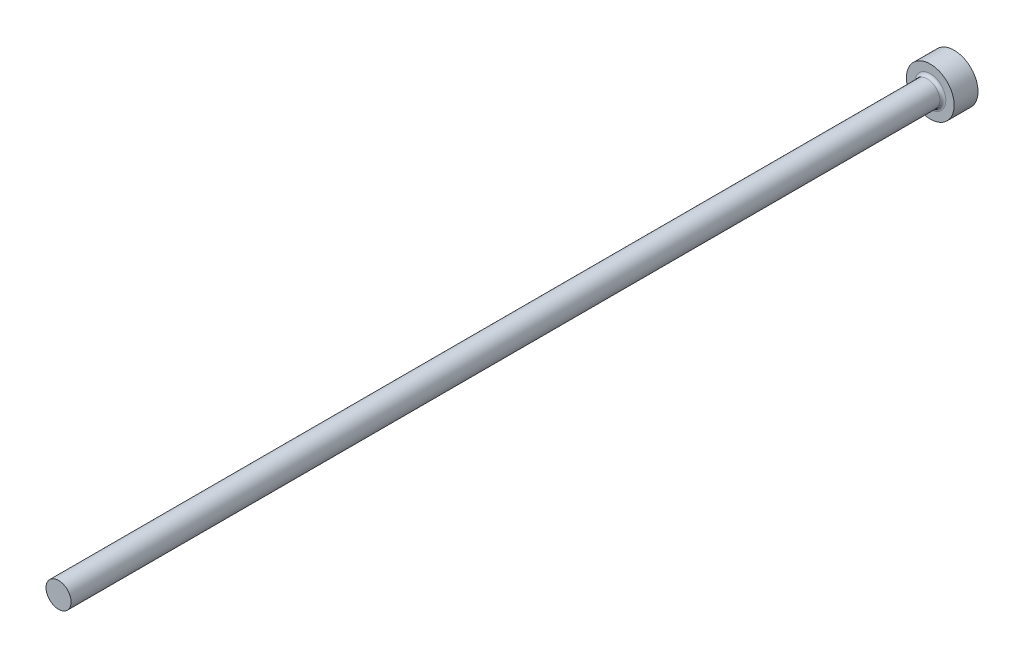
from build123d import *

# Parameters (mm, degrees)
FILLET1_R = 0.5


with BuildPart() as part:
    # FV → Revolve1 (revolve)
    with BuildSketch(Plane(origin=(0, 0, 0), x_dir=(1, 0, 0), z_dir=(0, 1, 0)), mode=Mode.PRIVATE) as revolve1_sk:
        Polygon((0, 0), (4, 0), (4, -4), (2.1, -4), (2.1, -150), (0, -150), align=None)
    revolve(revolve1_sk.sketch.rotate(Axis((0, 0, -9.033228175), (0, 0, 1)), 180), axis=Axis((0, 0, -9.033228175), (0, 0, 1)))

    # Fillet1
    fillet1_edges = [part.edges().sort_by_distance(p)[0] for p in [
        (2.1, 0, 4),
    ]]
    fillet(fillet1_edges, radius=FILLET1_R)


solid = part.part
